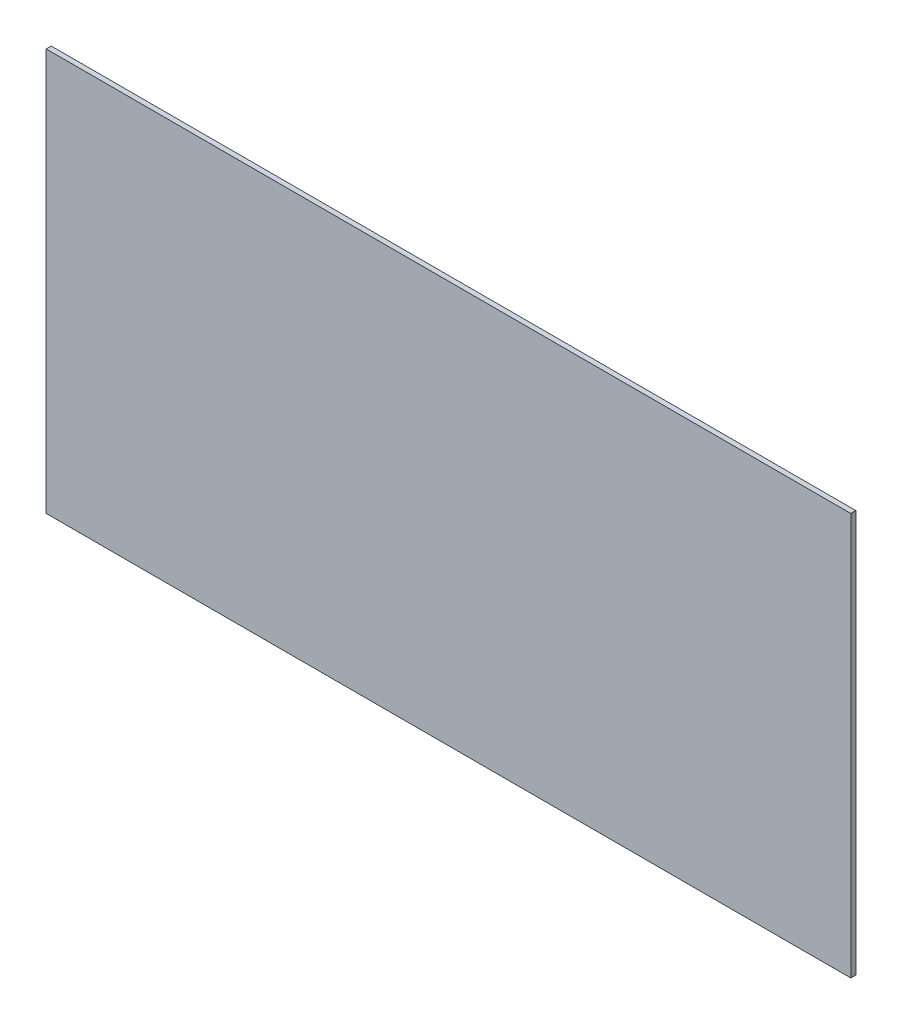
from build123d import *

# Parameters (mm, degrees)
SKETCH1_W           = 2032
SKETCH1_H           = 1016
BOSS_EXTRUDE1_DEPTH = 12.7


with BuildPart() as part:
    # Sketch1 → Boss-Extrude1 (new body)
    with BuildSketch(Plane.XY):
        with Locations((217.232403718, -47.899070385)):
            Rectangle(SKETCH1_W, SKETCH1_H)
    extrude(amount=BOSS_EXTRUDE1_DEPTH)


solid = part.part
